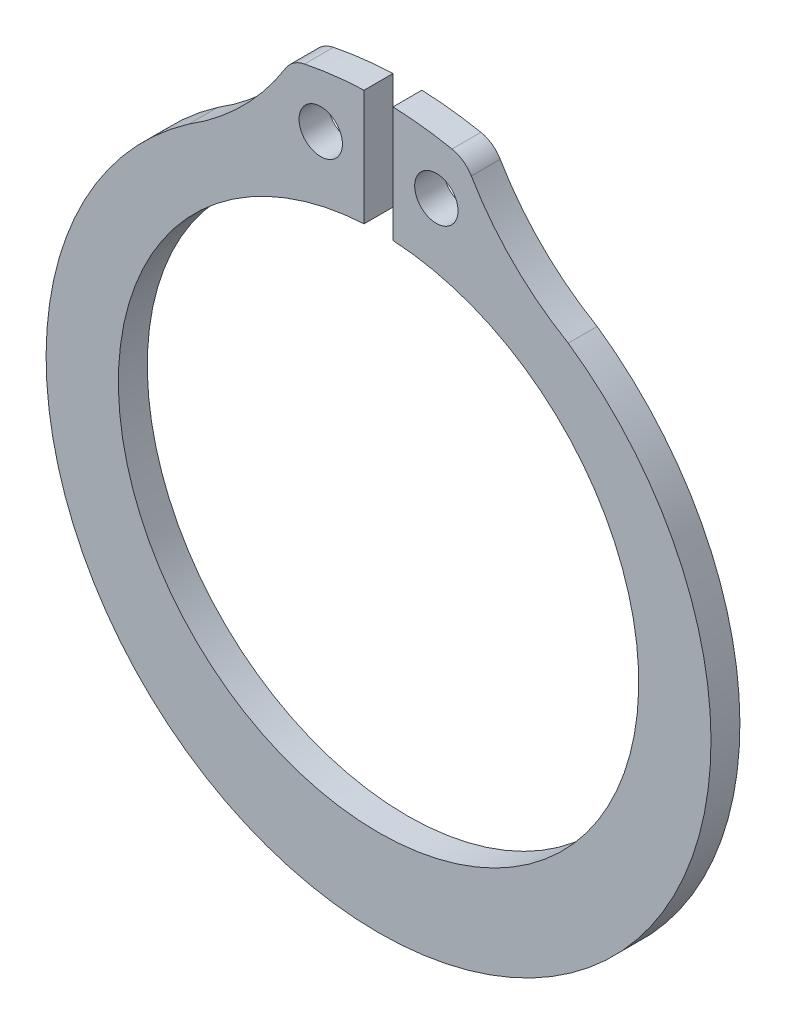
ISO-10303-21;
HEADER;
FILE_DESCRIPTION(('STEP AP214'),'2;1');
FILE_NAME('part.step','',(''),(''),'','','');
FILE_SCHEMA(('AUTOMOTIVE_DESIGN { 1 0 10303 214 1 1 1 1 }'));
ENDSEC;
DATA;
#1=APPLICATION_CONTEXT('core data for automotive mechanical design processes');
#2=APPLICATION_PROTOCOL_DEFINITION('international standard','automotive_design',2000,#1);
#3=PRODUCT_CONTEXT('',#1,'mechanical');
#4=PRODUCT('Part','Part','',(#3));
#5=PRODUCT_RELATED_PRODUCT_CATEGORY('part','',(#4));
#6=PRODUCT_DEFINITION_FORMATION('','',#4);
#7=PRODUCT_DEFINITION_CONTEXT('part definition',#1,'design');
#8=PRODUCT_DEFINITION('design','',#6,#7);
#9=PRODUCT_DEFINITION_SHAPE('','',#8);
#10=(LENGTH_UNIT() NAMED_UNIT(*) SI_UNIT(.MILLI.,.METRE.));
#11=(NAMED_UNIT(*) PLANE_ANGLE_UNIT() SI_UNIT($,.RADIAN.));
#12=(NAMED_UNIT(*) SI_UNIT($,.STERADIAN.) SOLID_ANGLE_UNIT());
#13=UNCERTAINTY_MEASURE_WITH_UNIT(LENGTH_MEASURE(1.E-05),#10,'distance_accuracy_value','');
#14=(GEOMETRIC_REPRESENTATION_CONTEXT(3) GLOBAL_UNCERTAINTY_ASSIGNED_CONTEXT((#13)) GLOBAL_UNIT_ASSIGNED_CONTEXT((#10,
#11,#12)) REPRESENTATION_CONTEXT('',''));
#15=CARTESIAN_POINT('',(0.,0.,0.));
#16=DIRECTION('',(0.,0.,1.));
#17=DIRECTION('',(1.,0.,0.));
#18=AXIS2_PLACEMENT_3D('',#15,#16,#17);
#19=CARTESIAN_POINT('',(0.,0.,1.));
#20=DIRECTION('',(0.,0.,-1.));
#21=DIRECTION('',(-1.,0.,0.));
#22=AXIS2_PLACEMENT_3D('',#19,#20,#21);
#23=CYLINDRICAL_SURFACE('',#22,13.);
#24=CARTESIAN_POINT('',(0.,0.,0.));
#25=DIRECTION('',(0.,0.,1.));
#26=DIRECTION('',(-1.,0.,0.));
#27=AXIS2_PLACEMENT_3D('',#24,#25,#26);
#28=CIRCLE('',#27,13.);
#29=CARTESIAN_POINT('',(-0.500000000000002,12.9903810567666,0.));
#30=VERTEX_POINT('',#29);
#31=CARTESIAN_POINT('',(-2.55963092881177,12.7455203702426,0.));
#32=VERTEX_POINT('',#31);
#33=EDGE_CURVE('E171',#30,#32,#28,.T.);
#34=ORIENTED_EDGE('',*,*,#33,.T.);
#35=DIRECTION('',(0.,0.,-1.));
#36=VECTOR('',#35,1.);
#37=CARTESIAN_POINT('',(-2.55963092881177,12.7455203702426,1.));
#38=LINE('',#37,#36);
#39=CARTESIAN_POINT('',(-2.55963092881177,12.7455203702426,1.));
#40=VERTEX_POINT('',#39);
#41=EDGE_CURVE('E125',#32,#40,#38,.F.);
#42=ORIENTED_EDGE('',*,*,#41,.T.);
#43=CARTESIAN_POINT('',(0.,0.,1.));
#44=DIRECTION('',(0.,0.,1.));
#45=DIRECTION('',(-1.,0.,0.));
#46=AXIS2_PLACEMENT_3D('',#43,#44,#45);
#47=CIRCLE('',#46,13.);
#48=CARTESIAN_POINT('',(-0.500000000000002,12.9903810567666,1.));
#49=VERTEX_POINT('',#48);
#50=EDGE_CURVE('E117',#49,#40,#47,.T.);
#51=ORIENTED_EDGE('',*,*,#50,.F.);
#52=DIRECTION('',(0.,0.,-1.));
#53=VECTOR('',#52,1.);
#54=CARTESIAN_POINT('',(-0.500000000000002,12.9903810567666,1.));
#55=LINE('',#54,#53);
#56=EDGE_CURVE('E100',#49,#30,#55,.T.);
#57=ORIENTED_EDGE('',*,*,#56,.T.);
#58=EDGE_LOOP('',(#34,#42,#51,#57));
#59=FACE_BOUND('',#58,.T.);
#60=ADVANCED_FACE('F24',(#59),#23,.T.);
#61=CARTESIAN_POINT('',(-6.04096398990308,8.6578085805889,1.));
#62=DIRECTION('',(0.,0.,-1.));
#63=DIRECTION('',(-1.,0.,0.));
#64=AXIS2_PLACEMENT_3D('',#61,#62,#63);
#65=PLANE('',#64);
#66=CARTESIAN_POINT('',(2.,11.,1.));
#67=DIRECTION('',(0.,0.,1.));
#68=DIRECTION('',(1.,0.,0.));
#69=AXIS2_PLACEMENT_3D('',#66,#67,#68);
#70=CIRCLE('',#69,0.75);
#71=CARTESIAN_POINT('',(2.75,11.,1.));
#72=VERTEX_POINT('',#71);
#73=EDGE_CURVE('E111',#72,#72,#70,.T.);
#74=ORIENTED_EDGE('',*,*,#73,.F.);
#75=EDGE_LOOP('',(#74));
#76=FACE_BOUND('',#75,.T.);
#77=CARTESIAN_POINT('',(-2.,11.,1.));
#78=DIRECTION('',(0.,0.,1.));
#79=DIRECTION('',(1.,0.,0.));
#80=AXIS2_PLACEMENT_3D('',#77,#78,#79);
#81=CIRCLE('',#80,0.750000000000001);
#82=CARTESIAN_POINT('',(-1.25,11.,1.));
#83=VERTEX_POINT('',#82);
#84=EDGE_CURVE('E288',#83,#83,#81,.T.);
#85=ORIENTED_EDGE('',*,*,#84,.F.);
#86=EDGE_LOOP('',(#85));
#87=FACE_BOUND('',#86,.T.);
#88=ORIENTED_EDGE('',*,*,#50,.T.);
#89=CARTESIAN_POINT('',(-2.3627362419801,11.7650957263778,1.));
#90=DIRECTION('',(0.,0.,-1.));
#91=DIRECTION('',(-1.,0.,0.));
#92=AXIS2_PLACEMENT_3D('',#89,#90,#91);
#93=CIRCLE('',#92,1.);
#94=CARTESIAN_POINT('',(-3.21167433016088,12.2935880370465,1.));
#95=VERTEX_POINT('',#94);
#96=EDGE_CURVE('E152',#40,#95,#93,.F.);
#97=ORIENTED_EDGE('',*,*,#96,.T.);
#98=CARTESIAN_POINT('',(-12.0819279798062,17.8156171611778,1.));
#99=DIRECTION('',(0.,0.,-1.));
#100=DIRECTION('',(-1.,0.,0.));
#101=AXIS2_PLACEMENT_3D('',#98,#99,#100);
#102=CIRCLE('',#101,10.4486461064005);
#103=CARTESIAN_POINT('',(-6.56197491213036,8.94407143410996,1.));
#104=VERTEX_POINT('',#103);
#105=EDGE_CURVE('E170',#95,#104,#102,.T.);
#106=ORIENTED_EDGE('',*,*,#105,.T.);
#107=CARTESIAN_POINT('',(0.,-0.5,1.));
#108=DIRECTION('',(0.,0.,1.));
#109=DIRECTION('',(-1.,0.,0.));
#110=AXIS2_PLACEMENT_3D('',#107,#108,#109);
#111=CIRCLE('',#110,11.5);
#112=CARTESIAN_POINT('',(6.56197491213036,8.94407143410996,1.));
#113=VERTEX_POINT('',#112);
#114=EDGE_CURVE('E130',#104,#113,#111,.T.);
#115=ORIENTED_EDGE('',*,*,#114,.T.);
#116=CARTESIAN_POINT('',(11.2060693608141,16.9735784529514,1.));
#117=DIRECTION('',(0.,0.,-1.));
#118=DIRECTION('',(1.,0.,0.));
#119=AXIS2_PLACEMENT_3D('',#116,#117,#118);
#120=CIRCLE('',#119,9.27580703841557);
#121=CARTESIAN_POINT('',(3.20834378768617,12.2749635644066,1.));
#122=VERTEX_POINT('',#121);
#123=EDGE_CURVE('E127',#113,#122,#120,.T.);
#124=ORIENTED_EDGE('',*,*,#123,.T.);
#125=CARTESIAN_POINT('',(2.34613033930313,11.7684184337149,1.));
#126=DIRECTION('',(0.,0.,-1.));
#127=DIRECTION('',(-1.,0.,0.));
#128=AXIS2_PLACEMENT_3D('',#125,#126,#127);
#129=CIRCLE('',#128,1.);
#130=CARTESIAN_POINT('',(2.54164120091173,12.7491199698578,1.));
#131=VERTEX_POINT('',#130);
#132=EDGE_CURVE('E39',#122,#131,#129,.F.);
#133=ORIENTED_EDGE('',*,*,#132,.T.);
#134=CARTESIAN_POINT('',(0.499999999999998,12.9903810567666,1.));
#135=VERTEX_POINT('',#134);
#136=EDGE_CURVE('E126',#131,#135,#47,.T.);
#137=ORIENTED_EDGE('',*,*,#136,.T.);
#138=DIRECTION('',(0.,1.,0.));
#139=VECTOR('',#138,1.);
#140=CARTESIAN_POINT('',(0.499999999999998,14.,1.));
#141=LINE('',#140,#139);
#142=CARTESIAN_POINT('',(0.499999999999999,8.98610037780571,1.));
#143=VERTEX_POINT('',#142);
#144=EDGE_CURVE('E122',#143,#135,#141,.T.);
#145=ORIENTED_EDGE('',*,*,#144,.F.);
#146=CARTESIAN_POINT('',(0.,0.,1.));
#147=DIRECTION('',(0.,0.,1.));
#148=DIRECTION('',(1.,0.,0.));
#149=AXIS2_PLACEMENT_3D('',#146,#147,#148);
#150=CIRCLE('',#149,9.);
#151=CARTESIAN_POINT('',(-0.500000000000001,8.98610037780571,1.));
#152=VERTEX_POINT('',#151);
#153=EDGE_CURVE('E121',#152,#143,#150,.T.);
#154=ORIENTED_EDGE('',*,*,#153,.F.);
#155=DIRECTION('',(0.,-1.,0.));
#156=VECTOR('',#155,1.);
#157=CARTESIAN_POINT('',(-0.500000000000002,14.,1.));
#158=LINE('',#157,#156);
#159=EDGE_CURVE('E103',#49,#152,#158,.T.);
#160=ORIENTED_EDGE('',*,*,#159,.F.);
#161=EDGE_LOOP('',(#88,#97,#106,#115,#124,#133,#137,#145,#154,#160));
#162=FACE_BOUND('',#161,.T.);
#163=ADVANCED_FACE('F116',(#76,#87,#162),#65,.F.);
#164=CARTESIAN_POINT('',(-6.04096398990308,8.6578085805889,0.));
#165=DIRECTION('',(0.,0.,-1.));
#166=DIRECTION('',(-1.,0.,0.));
#167=AXIS2_PLACEMENT_3D('',#164,#165,#166);
#168=PLANE('',#167);
#169=CARTESIAN_POINT('',(-12.0819279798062,17.8156171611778,0.));
#170=DIRECTION('',(0.,0.,-1.));
#171=DIRECTION('',(-1.,0.,0.));
#172=AXIS2_PLACEMENT_3D('',#169,#170,#171);
#173=CIRCLE('',#172,10.4486461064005);
#174=CARTESIAN_POINT('',(-3.21167433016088,12.2935880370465,0.));
#175=VERTEX_POINT('',#174);
#176=CARTESIAN_POINT('',(-6.56197491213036,8.94407143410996,0.));
#177=VERTEX_POINT('',#176);
#178=EDGE_CURVE('E279',#175,#177,#173,.T.);
#179=ORIENTED_EDGE('',*,*,#178,.F.);
#180=CARTESIAN_POINT('',(-2.3627362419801,11.7650957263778,0.));
#181=DIRECTION('',(0.,0.,-1.));
#182=DIRECTION('',(-1.,0.,0.));
#183=AXIS2_PLACEMENT_3D('',#180,#181,#182);
#184=CIRCLE('',#183,1.);
#185=EDGE_CURVE('E148',#175,#32,#184,.T.);
#186=ORIENTED_EDGE('',*,*,#185,.T.);
#187=ORIENTED_EDGE('',*,*,#33,.F.);
#188=DIRECTION('',(0.,-1.,0.));
#189=VECTOR('',#188,1.);
#190=CARTESIAN_POINT('',(-0.500000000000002,14.,0.));
#191=LINE('',#190,#189);
#192=CARTESIAN_POINT('',(-0.500000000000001,8.98610037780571,0.));
#193=VERTEX_POINT('',#192);
#194=EDGE_CURVE('E106',#30,#193,#191,.T.);
#195=ORIENTED_EDGE('',*,*,#194,.T.);
#196=CARTESIAN_POINT('',(0.,0.,0.));
#197=DIRECTION('',(0.,0.,1.));
#198=DIRECTION('',(1.,0.,0.));
#199=AXIS2_PLACEMENT_3D('',#196,#197,#198);
#200=CIRCLE('',#199,9.);
#201=CARTESIAN_POINT('',(0.499999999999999,8.98610037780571,0.));
#202=VERTEX_POINT('',#201);
#203=EDGE_CURVE('E281',#193,#202,#200,.T.);
#204=ORIENTED_EDGE('',*,*,#203,.T.);
#205=DIRECTION('',(0.,1.,0.));
#206=VECTOR('',#205,1.);
#207=CARTESIAN_POINT('',(0.499999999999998,14.,0.));
#208=LINE('',#207,#206);
#209=CARTESIAN_POINT('',(0.499999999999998,12.9903810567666,0.));
#210=VERTEX_POINT('',#209);
#211=EDGE_CURVE('E169',#202,#210,#208,.T.);
#212=ORIENTED_EDGE('',*,*,#211,.T.);
#213=CARTESIAN_POINT('',(2.54164120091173,12.7491199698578,0.));
#214=VERTEX_POINT('',#213);
#215=EDGE_CURVE('E159',#214,#210,#28,.T.);
#216=ORIENTED_EDGE('',*,*,#215,.F.);
#217=CARTESIAN_POINT('',(2.34613033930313,11.7684184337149,0.));
#218=DIRECTION('',(0.,0.,-1.));
#219=DIRECTION('',(-1.,0.,0.));
#220=AXIS2_PLACEMENT_3D('',#217,#218,#219);
#221=CIRCLE('',#220,1.);
#222=CARTESIAN_POINT('',(3.20834378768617,12.2749635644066,0.));
#223=VERTEX_POINT('',#222);
#224=EDGE_CURVE('E146',#214,#223,#221,.T.);
#225=ORIENTED_EDGE('',*,*,#224,.T.);
#226=CARTESIAN_POINT('',(11.2060693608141,16.9735784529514,0.));
#227=DIRECTION('',(0.,0.,-1.));
#228=DIRECTION('',(1.,0.,0.));
#229=AXIS2_PLACEMENT_3D('',#226,#227,#228);
#230=CIRCLE('',#229,9.27580703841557);
#231=CARTESIAN_POINT('',(6.56197491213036,8.94407143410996,0.));
#232=VERTEX_POINT('',#231);
#233=EDGE_CURVE('E174',#232,#223,#230,.T.);
#234=ORIENTED_EDGE('',*,*,#233,.F.);
#235=CARTESIAN_POINT('',(0.,-0.5,0.));
#236=DIRECTION('',(0.,0.,1.));
#237=DIRECTION('',(-1.,0.,0.));
#238=AXIS2_PLACEMENT_3D('',#235,#236,#237);
#239=CIRCLE('',#238,11.5);
#240=EDGE_CURVE('E184',#177,#232,#239,.T.);
#241=ORIENTED_EDGE('',*,*,#240,.F.);
#242=EDGE_LOOP('',(#179,#186,#187,#195,#204,#212,#216,#225,#234,#241));
#243=FACE_BOUND('',#242,.T.);
#244=CARTESIAN_POINT('',(2.,11.,0.));
#245=DIRECTION('',(0.,0.,1.));
#246=DIRECTION('',(1.,0.,0.));
#247=AXIS2_PLACEMENT_3D('',#244,#245,#246);
#248=CIRCLE('',#247,0.75);
#249=CARTESIAN_POINT('',(2.75,11.,0.));
#250=VERTEX_POINT('',#249);
#251=EDGE_CURVE('E291',#250,#250,#248,.T.);
#252=ORIENTED_EDGE('',*,*,#251,.T.);
#253=EDGE_LOOP('',(#252));
#254=FACE_BOUND('',#253,.T.);
#255=CARTESIAN_POINT('',(-2.,11.,0.));
#256=DIRECTION('',(0.,0.,1.));
#257=DIRECTION('',(1.,0.,0.));
#258=AXIS2_PLACEMENT_3D('',#255,#256,#257);
#259=CIRCLE('',#258,0.750000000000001);
#260=CARTESIAN_POINT('',(-1.25,11.,0.));
#261=VERTEX_POINT('',#260);
#262=EDGE_CURVE('E285',#261,#261,#259,.T.);
#263=ORIENTED_EDGE('',*,*,#262,.T.);
#264=EDGE_LOOP('',(#263));
#265=FACE_BOUND('',#264,.T.);
#266=ADVANCED_FACE('F165',(#243,#254,#265),#168,.T.);
#267=CARTESIAN_POINT('',(-12.0819279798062,17.8156171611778,1.));
#268=DIRECTION('',(0.,0.,-1.));
#269=DIRECTION('',(-1.,0.,0.));
#270=AXIS2_PLACEMENT_3D('',#267,#268,#269);
#271=CYLINDRICAL_SURFACE('',#270,10.4486461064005);
#272=ORIENTED_EDGE('',*,*,#105,.F.);
#273=DIRECTION('',(0.,0.,-1.));
#274=VECTOR('',#273,1.);
#275=CARTESIAN_POINT('',(-3.21167433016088,12.2935880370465,1.));
#276=LINE('',#275,#274);
#277=EDGE_CURVE('E143',#95,#175,#276,.T.);
#278=ORIENTED_EDGE('',*,*,#277,.T.);
#279=ORIENTED_EDGE('',*,*,#178,.T.);
#280=DIRECTION('',(0.,0.,-1.));
#281=VECTOR('',#280,1.);
#282=CARTESIAN_POINT('',(-6.56197491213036,8.94407143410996,1.));
#283=LINE('',#282,#281);
#284=EDGE_CURVE('E136',#104,#177,#283,.T.);
#285=ORIENTED_EDGE('',*,*,#284,.F.);
#286=EDGE_LOOP('',(#272,#278,#279,#285));
#287=FACE_BOUND('',#286,.T.);
#288=ADVANCED_FACE('F26',(#287),#271,.F.);
#289=CARTESIAN_POINT('',(0.,-0.5,1.));
#290=DIRECTION('',(0.,0.,-1.));
#291=DIRECTION('',(-1.,0.,0.));
#292=AXIS2_PLACEMENT_3D('',#289,#290,#291);
#293=CYLINDRICAL_SURFACE('',#292,11.5);
#294=ORIENTED_EDGE('',*,*,#240,.T.);
#295=DIRECTION('',(0.,0.,-1.));
#296=VECTOR('',#295,1.);
#297=CARTESIAN_POINT('',(6.56197491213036,8.94407143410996,1.));
#298=LINE('',#297,#296);
#299=EDGE_CURVE('E129',#113,#232,#298,.T.);
#300=ORIENTED_EDGE('',*,*,#299,.F.);
#301=ORIENTED_EDGE('',*,*,#114,.F.);
#302=ORIENTED_EDGE('',*,*,#284,.T.);
#303=EDGE_LOOP('',(#294,#300,#301,#302));
#304=FACE_BOUND('',#303,.T.);
#305=ADVANCED_FACE('F182',(#304),#293,.T.);
#306=CARTESIAN_POINT('',(11.2060693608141,16.9735784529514,1.));
#307=DIRECTION('',(0.,0.,-1.));
#308=DIRECTION('',(-1.,0.,0.));
#309=AXIS2_PLACEMENT_3D('',#306,#307,#308);
#310=CYLINDRICAL_SURFACE('',#309,9.27580703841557);
#311=ORIENTED_EDGE('',*,*,#233,.T.);
#312=DIRECTION('',(0.,0.,-1.));
#313=VECTOR('',#312,1.);
#314=CARTESIAN_POINT('',(3.20834378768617,12.2749635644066,1.));
#315=LINE('',#314,#313);
#316=EDGE_CURVE('E11',#223,#122,#315,.F.);
#317=ORIENTED_EDGE('',*,*,#316,.T.);
#318=ORIENTED_EDGE('',*,*,#123,.F.);
#319=ORIENTED_EDGE('',*,*,#299,.T.);
#320=EDGE_LOOP('',(#311,#317,#318,#319));
#321=FACE_BOUND('',#320,.T.);
#322=ADVANCED_FACE('F185',(#321),#310,.F.);
#323=ORIENTED_EDGE('',*,*,#136,.F.);
#324=DIRECTION('',(0.,0.,-1.));
#325=VECTOR('',#324,1.);
#326=CARTESIAN_POINT('',(2.54164120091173,12.7491199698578,1.));
#327=LINE('',#326,#325);
#328=EDGE_CURVE('E32',#131,#214,#327,.T.);
#329=ORIENTED_EDGE('',*,*,#328,.T.);
#330=ORIENTED_EDGE('',*,*,#215,.T.);
#331=DIRECTION('',(0.,0.,-1.));
#332=VECTOR('',#331,1.);
#333=CARTESIAN_POINT('',(0.499999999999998,12.9903810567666,1.));
#334=LINE('',#333,#332);
#335=EDGE_CURVE('E112',#210,#135,#334,.F.);
#336=ORIENTED_EDGE('',*,*,#335,.T.);
#337=EDGE_LOOP('',(#323,#329,#330,#336));
#338=FACE_BOUND('',#337,.T.);
#339=ADVANCED_FACE('F157',(#338),#23,.T.);
#340=CARTESIAN_POINT('',(0.,0.,1.));
#341=DIRECTION('',(0.,0.,-1.));
#342=DIRECTION('',(-1.,0.,0.));
#343=AXIS2_PLACEMENT_3D('',#340,#341,#342);
#344=CYLINDRICAL_SURFACE('',#343,9.);
#345=DIRECTION('',(0.,0.,-1.));
#346=VECTOR('',#345,1.);
#347=CARTESIAN_POINT('',(-0.500000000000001,8.98610037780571,1.));
#348=LINE('',#347,#346);
#349=EDGE_CURVE('E141',#152,#193,#348,.T.);
#350=ORIENTED_EDGE('',*,*,#349,.F.);
#351=ORIENTED_EDGE('',*,*,#153,.T.);
#352=DIRECTION('',(0.,0.,-1.));
#353=VECTOR('',#352,1.);
#354=CARTESIAN_POINT('',(0.499999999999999,8.98610037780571,1.));
#355=LINE('',#354,#353);
#356=EDGE_CURVE('E139',#202,#143,#355,.F.);
#357=ORIENTED_EDGE('',*,*,#356,.F.);
#358=ORIENTED_EDGE('',*,*,#203,.F.);
#359=EDGE_LOOP('',(#350,#351,#357,#358));
#360=FACE_BOUND('',#359,.T.);
#361=ADVANCED_FACE('F192',(#360),#344,.F.);
#362=CARTESIAN_POINT('',(-2.,11.,0.));
#363=DIRECTION('',(0.,0.,1.));
#364=DIRECTION('',(1.,0.,0.));
#365=AXIS2_PLACEMENT_3D('',#362,#363,#364);
#366=CYLINDRICAL_SURFACE('',#365,0.750000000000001);
#367=ORIENTED_EDGE('',*,*,#262,.F.);
#368=EDGE_LOOP('',(#367));
#369=FACE_BOUND('',#368,.T.);
#370=ORIENTED_EDGE('',*,*,#84,.T.);
#371=EDGE_LOOP('',(#370));
#372=FACE_BOUND('',#371,.T.);
#373=ADVANCED_FACE('F205',(#369,#372),#366,.F.);
#374=CARTESIAN_POINT('',(2.,11.,0.));
#375=DIRECTION('',(0.,0.,1.));
#376=DIRECTION('',(1.,0.,0.));
#377=AXIS2_PLACEMENT_3D('',#374,#375,#376);
#378=CYLINDRICAL_SURFACE('',#377,0.75);
#379=ORIENTED_EDGE('',*,*,#251,.F.);
#380=EDGE_LOOP('',(#379));
#381=FACE_BOUND('',#380,.T.);
#382=ORIENTED_EDGE('',*,*,#73,.T.);
#383=EDGE_LOOP('',(#382));
#384=FACE_BOUND('',#383,.T.);
#385=ADVANCED_FACE('F209',(#381,#384),#378,.F.);
#386=CARTESIAN_POINT('',(0.499999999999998,14.,0.));
#387=DIRECTION('',(1.,0.,0.));
#388=DIRECTION('',(0.,1.,0.));
#389=AXIS2_PLACEMENT_3D('',#386,#387,#388);
#390=PLANE('',#389);
#391=ORIENTED_EDGE('',*,*,#211,.F.);
#392=ORIENTED_EDGE('',*,*,#356,.T.);
#393=ORIENTED_EDGE('',*,*,#144,.T.);
#394=ORIENTED_EDGE('',*,*,#335,.F.);
#395=EDGE_LOOP('',(#391,#392,#393,#394));
#396=FACE_BOUND('',#395,.T.);
#397=ADVANCED_FACE('F213',(#396),#390,.F.);
#398=CARTESIAN_POINT('',(-0.500000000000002,14.,0.));
#399=DIRECTION('',(-1.,0.,0.));
#400=DIRECTION('',(0.,-1.,0.));
#401=AXIS2_PLACEMENT_3D('',#398,#399,#400);
#402=PLANE('',#401);
#403=ORIENTED_EDGE('',*,*,#159,.T.);
#404=ORIENTED_EDGE('',*,*,#349,.T.);
#405=ORIENTED_EDGE('',*,*,#194,.F.);
#406=ORIENTED_EDGE('',*,*,#56,.F.);
#407=EDGE_LOOP('',(#403,#404,#405,#406));
#408=FACE_BOUND('',#407,.T.);
#409=ADVANCED_FACE('F102',(#408),#402,.F.);
#410=CARTESIAN_POINT('',(-2.3627362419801,11.7650957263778,1.));
#411=DIRECTION('',(0.,0.,1.));
#412=DIRECTION('',(1.,0.,0.));
#413=AXIS2_PLACEMENT_3D('',#410,#411,#412);
#414=CYLINDRICAL_SURFACE('',#413,1.);
#415=ORIENTED_EDGE('',*,*,#96,.F.);
#416=ORIENTED_EDGE('',*,*,#41,.F.);
#417=ORIENTED_EDGE('',*,*,#185,.F.);
#418=ORIENTED_EDGE('',*,*,#277,.F.);
#419=EDGE_LOOP('',(#415,#416,#417,#418));
#420=FACE_BOUND('',#419,.T.);
#421=ADVANCED_FACE('F217',(#420),#414,.T.);
#422=CARTESIAN_POINT('',(2.34613033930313,11.7684184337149,1.));
#423=DIRECTION('',(0.,0.,1.));
#424=DIRECTION('',(1.,0.,0.));
#425=AXIS2_PLACEMENT_3D('',#422,#423,#424);
#426=CYLINDRICAL_SURFACE('',#425,1.);
#427=ORIENTED_EDGE('',*,*,#132,.F.);
#428=ORIENTED_EDGE('',*,*,#316,.F.);
#429=ORIENTED_EDGE('',*,*,#224,.F.);
#430=ORIENTED_EDGE('',*,*,#328,.F.);
#431=EDGE_LOOP('',(#427,#428,#429,#430));
#432=FACE_BOUND('',#431,.T.);
#433=ADVANCED_FACE('F223',(#432),#426,.T.);
#434=CLOSED_SHELL('',(#60,#163,#266,#288,#305,#322,#339,#361,#373,#385,#397,#409,#421,#433));
#435=MANIFOLD_SOLID_BREP('B2',#434);
#436=ADVANCED_BREP_SHAPE_REPRESENTATION('',(#18,#435),#14);
#437=SHAPE_DEFINITION_REPRESENTATION(#9,#436);
ENDSEC;
END-ISO-10303-21;
